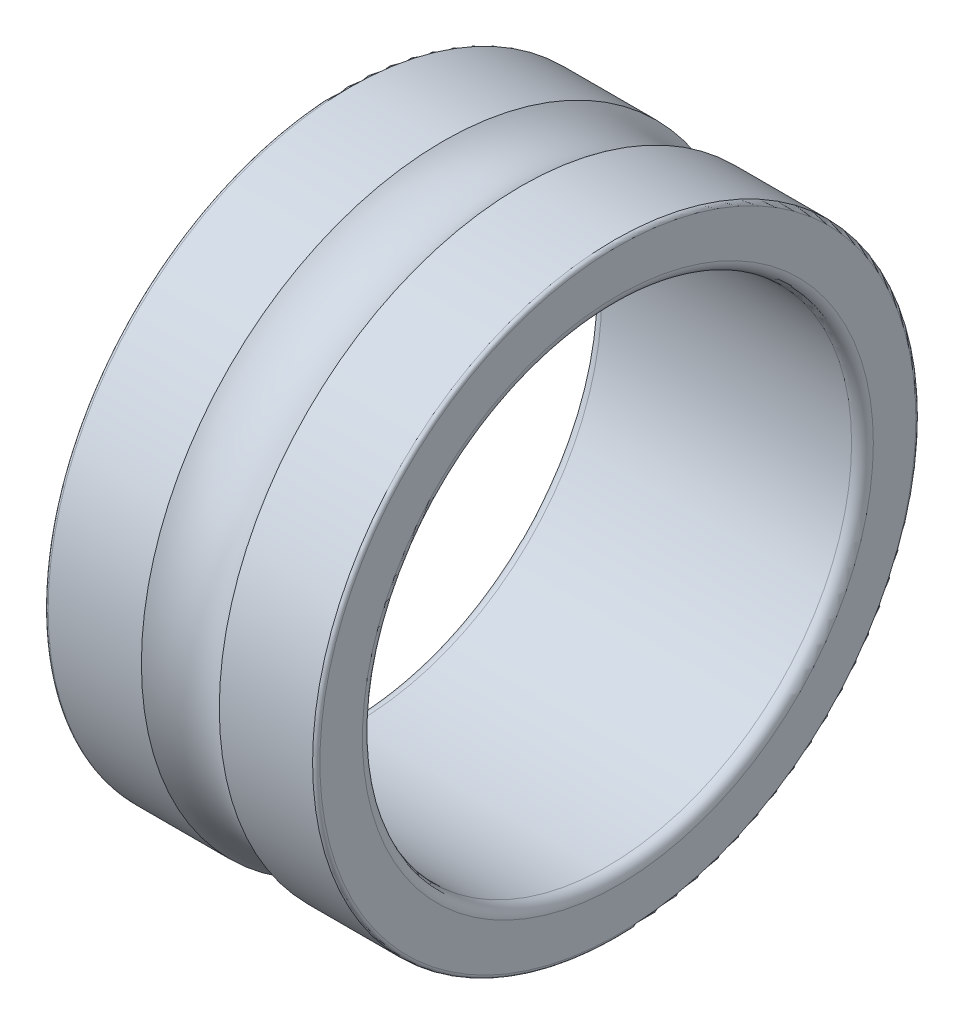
ISO-10303-21;
HEADER;
FILE_DESCRIPTION(('STEP AP214'),'2;1');
FILE_NAME('part.step','',(''),(''),'','','');
FILE_SCHEMA(('AUTOMOTIVE_DESIGN { 1 0 10303 214 1 1 1 1 }'));
ENDSEC;
DATA;
#1=APPLICATION_CONTEXT('core data for automotive mechanical design processes');
#2=APPLICATION_PROTOCOL_DEFINITION('international standard','automotive_design',2000,#1);
#3=PRODUCT_CONTEXT('',#1,'mechanical');
#4=PRODUCT('Part','Part','',(#3));
#5=PRODUCT_RELATED_PRODUCT_CATEGORY('part','',(#4));
#6=PRODUCT_DEFINITION_FORMATION('','',#4);
#7=PRODUCT_DEFINITION_CONTEXT('part definition',#1,'design');
#8=PRODUCT_DEFINITION('design','',#6,#7);
#9=PRODUCT_DEFINITION_SHAPE('','',#8);
#10=(LENGTH_UNIT() NAMED_UNIT(*) SI_UNIT(.MILLI.,.METRE.));
#11=(NAMED_UNIT(*) PLANE_ANGLE_UNIT() SI_UNIT($,.RADIAN.));
#12=(NAMED_UNIT(*) SI_UNIT($,.STERADIAN.) SOLID_ANGLE_UNIT());
#13=UNCERTAINTY_MEASURE_WITH_UNIT(LENGTH_MEASURE(1.E-05),#10,'distance_accuracy_value','');
#14=(GEOMETRIC_REPRESENTATION_CONTEXT(3) GLOBAL_UNCERTAINTY_ASSIGNED_CONTEXT((#13)) GLOBAL_UNIT_ASSIGNED_CONTEXT((#10,
#11,#12)) REPRESENTATION_CONTEXT('',''));
#15=CARTESIAN_POINT('',(0.,0.,0.));
#16=DIRECTION('',(0.,0.,1.));
#17=DIRECTION('',(1.,0.,0.));
#18=AXIS2_PLACEMENT_3D('',#15,#16,#17);
#19=CARTESIAN_POINT('',(0.200000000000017,0.,0.));
#20=DIRECTION('',(1.,0.,0.));
#21=DIRECTION('',(0.,0.,-1.));
#22=AXIS2_PLACEMENT_3D('',#19,#20,#21);
#23=TOROIDAL_SURFACE('',#22,4.70000000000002,0.200000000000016);
#24=CARTESIAN_POINT('',(0.199999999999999,0.,0.));
#25=DIRECTION('',(1.,0.,0.));
#26=DIRECTION('',(0.,0.,-1.));
#27=AXIS2_PLACEMENT_3D('',#24,#25,#26);
#28=CIRCLE('',#27,4.5);
#29=CARTESIAN_POINT('',(0.199999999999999,0.,-4.5));
#30=VERTEX_POINT('',#29);
#31=EDGE_CURVE('E10',#30,#30,#28,.T.);
#32=ORIENTED_EDGE('',*,*,#31,.T.);
#33=EDGE_LOOP('',(#32));
#34=FACE_BOUND('',#33,.T.);
#35=CARTESIAN_POINT('',(0.,0.,0.));
#36=DIRECTION('',(1.,0.,0.));
#37=DIRECTION('',(0.,0.,-1.));
#38=AXIS2_PLACEMENT_3D('',#35,#36,#37);
#39=CIRCLE('',#38,4.7);
#40=CARTESIAN_POINT('',(0.,0.,-4.7));
#41=VERTEX_POINT('',#40);
#42=EDGE_CURVE('E70',#41,#41,#39,.T.);
#43=ORIENTED_EDGE('',*,*,#42,.F.);
#44=EDGE_LOOP('',(#43));
#45=FACE_BOUND('',#44,.T.);
#46=ADVANCED_FACE('F36',(#34,#45),#23,.T.);
#47=CARTESIAN_POINT('',(50.,0.,0.));
#48=DIRECTION('',(1.,0.,0.));
#49=DIRECTION('',(0.,0.,-1.));
#50=AXIS2_PLACEMENT_3D('',#47,#48,#49);
#51=CYLINDRICAL_SURFACE('',#50,4.5);
#52=CARTESIAN_POINT('',(4.8,0.,0.));
#53=DIRECTION('',(1.,0.,0.));
#54=DIRECTION('',(0.,0.,-1.));
#55=AXIS2_PLACEMENT_3D('',#52,#53,#54);
#56=CIRCLE('',#55,4.5);
#57=CARTESIAN_POINT('',(4.8,0.,-4.5));
#58=VERTEX_POINT('',#57);
#59=EDGE_CURVE('E42',#58,#58,#56,.T.);
#60=ORIENTED_EDGE('',*,*,#59,.T.);
#61=EDGE_LOOP('',(#60));
#62=FACE_BOUND('',#61,.T.);
#63=ORIENTED_EDGE('',*,*,#31,.F.);
#64=EDGE_LOOP('',(#63));
#65=FACE_BOUND('',#64,.T.);
#66=ADVANCED_FACE('F78',(#62,#65),#51,.F.);
#67=CARTESIAN_POINT('',(4.79999999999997,0.,0.));
#68=DIRECTION('',(1.,0.,0.));
#69=DIRECTION('',(0.,0.,-1.));
#70=AXIS2_PLACEMENT_3D('',#67,#68,#69);
#71=TOROIDAL_SURFACE('',#70,4.70000000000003,0.200000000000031);
#72=CARTESIAN_POINT('',(5.,0.,0.));
#73=DIRECTION('',(1.,0.,0.));
#74=DIRECTION('',(0.,0.,-1.));
#75=AXIS2_PLACEMENT_3D('',#72,#73,#74);
#76=CIRCLE('',#75,4.7);
#77=CARTESIAN_POINT('',(5.,0.,-4.7));
#78=VERTEX_POINT('',#77);
#79=EDGE_CURVE('E46',#78,#78,#76,.T.);
#80=ORIENTED_EDGE('',*,*,#79,.T.);
#81=EDGE_LOOP('',(#80));
#82=FACE_BOUND('',#81,.T.);
#83=ORIENTED_EDGE('',*,*,#59,.F.);
#84=EDGE_LOOP('',(#83));
#85=FACE_BOUND('',#84,.T.);
#86=ADVANCED_FACE('F82',(#82,#85),#71,.T.);
#87=CARTESIAN_POINT('',(5.,4.7,0.));
#88=DIRECTION('',(1.,0.,0.));
#89=DIRECTION('',(0.,0.,-1.));
#90=AXIS2_PLACEMENT_3D('',#87,#88,#89);
#91=PLANE('',#90);
#92=CARTESIAN_POINT('',(5.,0.,0.));
#93=DIRECTION('',(1.,0.,0.));
#94=DIRECTION('',(0.,0.,-1.));
#95=AXIS2_PLACEMENT_3D('',#92,#93,#94);
#96=CIRCLE('',#95,5.483);
#97=CARTESIAN_POINT('',(5.,0.,-5.483));
#98=VERTEX_POINT('',#97);
#99=EDGE_CURVE('E50',#98,#98,#96,.T.);
#100=ORIENTED_EDGE('',*,*,#99,.T.);
#101=EDGE_LOOP('',(#100));
#102=FACE_BOUND('',#101,.T.);
#103=ORIENTED_EDGE('',*,*,#79,.F.);
#104=EDGE_LOOP('',(#103));
#105=FACE_BOUND('',#104,.T.);
#106=ADVANCED_FACE('F86',(#102,#105),#91,.T.);
#107=CARTESIAN_POINT('',(4.93300000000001,0.,0.));
#108=DIRECTION('',(1.,0.,0.));
#109=DIRECTION('',(0.,0.,-1.));
#110=AXIS2_PLACEMENT_3D('',#107,#108,#109);
#111=TOROIDAL_SURFACE('',#110,5.483,0.0669999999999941);
#112=CARTESIAN_POINT('',(4.933,0.,0.));
#113=DIRECTION('',(1.,0.,0.));
#114=DIRECTION('',(0.,0.,-1.));
#115=AXIS2_PLACEMENT_3D('',#112,#113,#114);
#116=CIRCLE('',#115,5.55);
#117=CARTESIAN_POINT('',(4.933,0.,-5.55));
#118=VERTEX_POINT('',#117);
#119=EDGE_CURVE('E55',#118,#118,#116,.T.);
#120=ORIENTED_EDGE('',*,*,#119,.T.);
#121=EDGE_LOOP('',(#120));
#122=FACE_BOUND('',#121,.T.);
#123=ORIENTED_EDGE('',*,*,#99,.F.);
#124=EDGE_LOOP('',(#123));
#125=FACE_BOUND('',#124,.T.);
#126=ADVANCED_FACE('F93',(#122,#125),#111,.T.);
#127=CARTESIAN_POINT('',(50.,0.,0.));
#128=DIRECTION('',(1.,0.,0.));
#129=DIRECTION('',(0.,0.,-1.));
#130=AXIS2_PLACEMENT_3D('',#127,#128,#129);
#131=CYLINDRICAL_SURFACE('',#130,5.55);
#132=CARTESIAN_POINT('',(3.2166589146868,0.,0.));
#133=DIRECTION('',(1.,0.,0.));
#134=DIRECTION('',(0.,0.,-1.));
#135=AXIS2_PLACEMENT_3D('',#132,#133,#134);
#136=CIRCLE('',#135,5.55);
#137=CARTESIAN_POINT('',(3.2166589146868,0.,-5.55));
#138=VERTEX_POINT('',#137);
#139=EDGE_CURVE('E58',#138,#138,#136,.T.);
#140=ORIENTED_EDGE('',*,*,#139,.T.);
#141=EDGE_LOOP('',(#140));
#142=FACE_BOUND('',#141,.T.);
#143=ORIENTED_EDGE('',*,*,#119,.F.);
#144=EDGE_LOOP('',(#143));
#145=FACE_BOUND('',#144,.T.);
#146=ADVANCED_FACE('F97',(#142,#145),#131,.T.);
#147=CARTESIAN_POINT('',(2.5,0.,0.));
#148=DIRECTION('',(1.,0.,0.));
#149=DIRECTION('',(0.,0.,-1.));
#150=AXIS2_PLACEMENT_3D('',#147,#148,#149);
#151=TOROIDAL_SURFACE('',#150,6.50000000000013,1.19000000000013);
#152=CARTESIAN_POINT('',(1.7833410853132,0.,0.));
#153=DIRECTION('',(1.,0.,0.));
#154=DIRECTION('',(0.,0.,-1.));
#155=AXIS2_PLACEMENT_3D('',#152,#153,#154);
#156=CIRCLE('',#155,5.55);
#157=CARTESIAN_POINT('',(1.7833410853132,0.,-5.55));
#158=VERTEX_POINT('',#157);
#159=EDGE_CURVE('E61',#158,#158,#156,.T.);
#160=ORIENTED_EDGE('',*,*,#159,.T.);
#161=EDGE_LOOP('',(#160));
#162=FACE_BOUND('',#161,.T.);
#163=ORIENTED_EDGE('',*,*,#139,.F.);
#164=EDGE_LOOP('',(#163));
#165=FACE_BOUND('',#164,.T.);
#166=ADVANCED_FACE('F101',(#162,#165),#151,.F.);
#167=CARTESIAN_POINT('',(50.,0.,0.));
#168=DIRECTION('',(1.,0.,0.));
#169=DIRECTION('',(0.,0.,-1.));
#170=AXIS2_PLACEMENT_3D('',#167,#168,#169);
#171=CYLINDRICAL_SURFACE('',#170,5.55);
#172=CARTESIAN_POINT('',(0.0669999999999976,0.,0.));
#173=DIRECTION('',(1.,0.,0.));
#174=DIRECTION('',(0.,0.,-1.));
#175=AXIS2_PLACEMENT_3D('',#172,#173,#174);
#176=CIRCLE('',#175,5.55);
#177=CARTESIAN_POINT('',(0.0669999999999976,0.,-5.55));
#178=VERTEX_POINT('',#177);
#179=EDGE_CURVE('E64',#178,#178,#176,.T.);
#180=ORIENTED_EDGE('',*,*,#179,.T.);
#181=EDGE_LOOP('',(#180));
#182=FACE_BOUND('',#181,.T.);
#183=ORIENTED_EDGE('',*,*,#159,.F.);
#184=EDGE_LOOP('',(#183));
#185=FACE_BOUND('',#184,.T.);
#186=ADVANCED_FACE('F105',(#182,#185),#171,.T.);
#187=CARTESIAN_POINT('',(0.0669999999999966,0.,0.));
#188=DIRECTION('',(1.,0.,0.));
#189=DIRECTION('',(0.,0.,-1.));
#190=AXIS2_PLACEMENT_3D('',#187,#188,#189);
#191=TOROIDAL_SURFACE('',#190,5.483,0.0669999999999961);
#192=CARTESIAN_POINT('',(0.,0.,0.));
#193=DIRECTION('',(1.,0.,0.));
#194=DIRECTION('',(0.,0.,-1.));
#195=AXIS2_PLACEMENT_3D('',#192,#193,#194);
#196=CIRCLE('',#195,5.483);
#197=CARTESIAN_POINT('',(0.,0.,-5.483));
#198=VERTEX_POINT('',#197);
#199=EDGE_CURVE('E67',#198,#198,#196,.T.);
#200=ORIENTED_EDGE('',*,*,#199,.T.);
#201=EDGE_LOOP('',(#200));
#202=FACE_BOUND('',#201,.T.);
#203=ORIENTED_EDGE('',*,*,#179,.F.);
#204=EDGE_LOOP('',(#203));
#205=FACE_BOUND('',#204,.T.);
#206=ADVANCED_FACE('F109',(#202,#205),#191,.T.);
#207=CARTESIAN_POINT('',(0.,5.483,0.));
#208=DIRECTION('',(-1.,0.,0.));
#209=DIRECTION('',(0.,0.,1.));
#210=AXIS2_PLACEMENT_3D('',#207,#208,#209);
#211=PLANE('',#210);
#212=ORIENTED_EDGE('',*,*,#42,.T.);
#213=EDGE_LOOP('',(#212));
#214=FACE_BOUND('',#213,.T.);
#215=ORIENTED_EDGE('',*,*,#199,.F.);
#216=EDGE_LOOP('',(#215));
#217=FACE_BOUND('',#216,.T.);
#218=ADVANCED_FACE('F74',(#214,#217),#211,.T.);
#219=CLOSED_SHELL('',(#46,#66,#86,#106,#126,#146,#166,#186,#206,#218));
#220=MANIFOLD_SOLID_BREP('B2',#219);
#221=ADVANCED_BREP_SHAPE_REPRESENTATION('',(#18,#220),#14);
#222=SHAPE_DEFINITION_REPRESENTATION(#9,#221);
ENDSEC;
END-ISO-10303-21;
